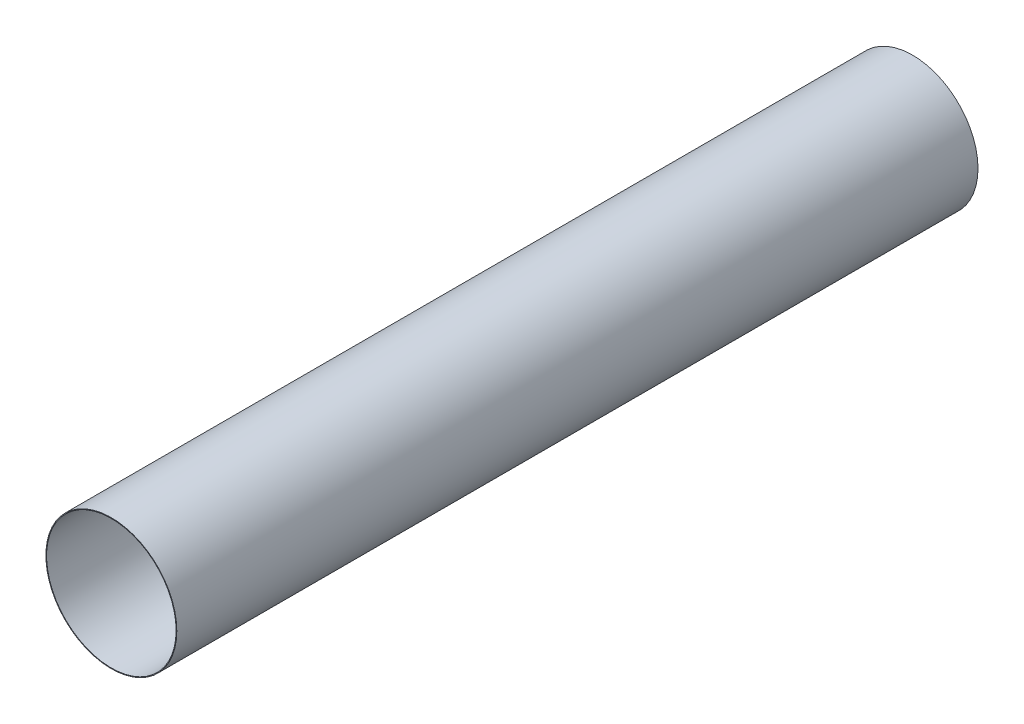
from build123d import *

# Parameters (mm, degrees)
SKETCH1_R           = 19.2
SKETCH1_R_2         = 19
BOSS_EXTRUDE1_DEPTH = 235


with BuildPart() as part:
    # Sketch1 → Boss-Extrude1 (new body)
    with BuildSketch(Plane.XY):
        Circle(SKETCH1_R)
        Circle(SKETCH1_R_2, mode=Mode.SUBTRACT)
    extrude(amount=-BOSS_EXTRUDE1_DEPTH)


solid = part.part
